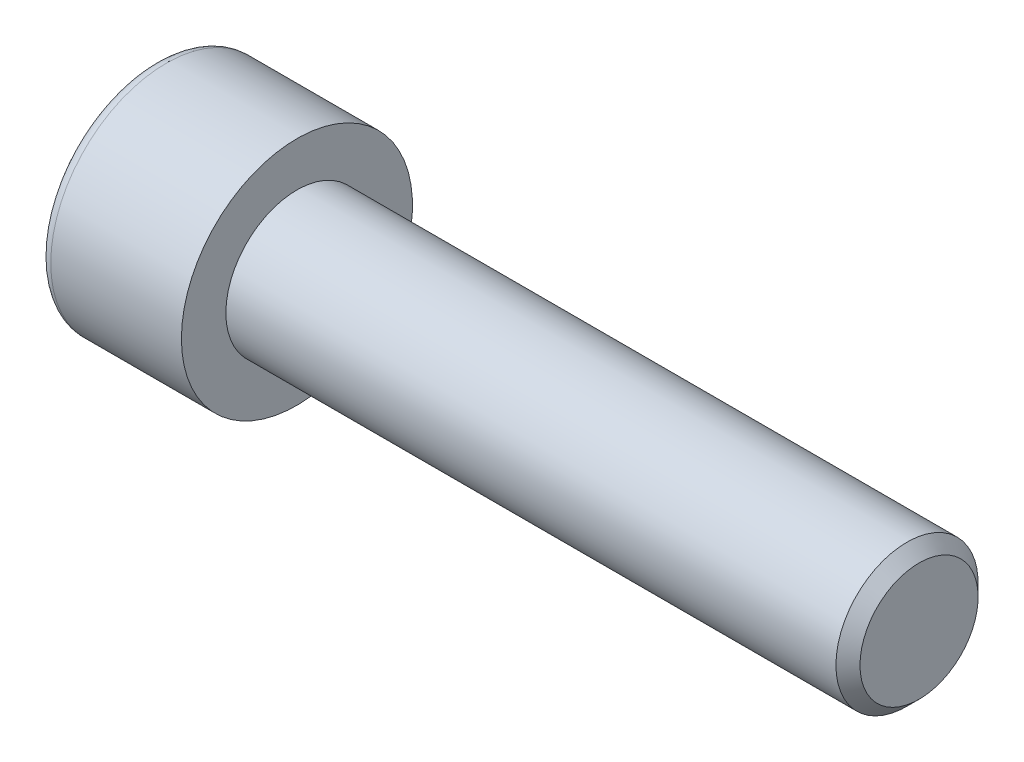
ISO-10303-21;
HEADER;
FILE_DESCRIPTION(('STEP AP214'),'2;1');
FILE_NAME('part.step','',(''),(''),'','','');
FILE_SCHEMA(('AUTOMOTIVE_DESIGN { 1 0 10303 214 1 1 1 1 }'));
ENDSEC;
DATA;
#1=APPLICATION_CONTEXT('core data for automotive mechanical design processes');
#2=APPLICATION_PROTOCOL_DEFINITION('international standard','automotive_design',2000,#1);
#3=PRODUCT_CONTEXT('',#1,'mechanical');
#4=PRODUCT('Part','Part','',(#3));
#5=PRODUCT_RELATED_PRODUCT_CATEGORY('part','',(#4));
#6=PRODUCT_DEFINITION_FORMATION('','',#4);
#7=PRODUCT_DEFINITION_CONTEXT('part definition',#1,'design');
#8=PRODUCT_DEFINITION('design','',#6,#7);
#9=PRODUCT_DEFINITION_SHAPE('','',#8);
#10=(LENGTH_UNIT() NAMED_UNIT(*) SI_UNIT(.MILLI.,.METRE.));
#11=(NAMED_UNIT(*) PLANE_ANGLE_UNIT() SI_UNIT($,.RADIAN.));
#12=(NAMED_UNIT(*) SI_UNIT($,.STERADIAN.) SOLID_ANGLE_UNIT());
#13=UNCERTAINTY_MEASURE_WITH_UNIT(LENGTH_MEASURE(1.E-05),#10,'distance_accuracy_value','');
#14=(GEOMETRIC_REPRESENTATION_CONTEXT(3) GLOBAL_UNCERTAINTY_ASSIGNED_CONTEXT((#13)) GLOBAL_UNIT_ASSIGNED_CONTEXT((#10,
#11,#12)) REPRESENTATION_CONTEXT('',''));
#15=CARTESIAN_POINT('',(0.,0.,0.));
#16=DIRECTION('',(0.,0.,1.));
#17=DIRECTION('',(1.,0.,0.));
#18=AXIS2_PLACEMENT_3D('',#15,#16,#17);
#19=CARTESIAN_POINT('',(0.,0.,0.));
#20=DIRECTION('',(-0.999999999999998,0.,0.));
#21=DIRECTION('',(0.,0.,0.999999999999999));
#22=AXIS2_PLACEMENT_3D('',#19,#20,#21);
#23=PLANE('',#22);
#24=CARTESIAN_POINT('',(0.,0.,0.));
#25=DIRECTION('',(-0.999999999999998,0.,0.));
#26=DIRECTION('',(0.,0.,0.999999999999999));
#27=AXIS2_PLACEMENT_3D('',#24,#25,#26);
#28=CIRCLE('',#27,6.5);
#29=CARTESIAN_POINT('',(0.,0.,6.49999999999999));
#30=VERTEX_POINT('',#29);
#31=EDGE_CURVE('E135',#30,#30,#28,.T.);
#32=ORIENTED_EDGE('',*,*,#31,.F.);
#33=EDGE_LOOP('',(#32));
#34=FACE_BOUND('',#33,.T.);
#35=CARTESIAN_POINT('',(0.,0.,0.));
#36=DIRECTION('',(-0.999999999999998,0.,0.));
#37=DIRECTION('',(0.,0.,0.999999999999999));
#38=AXIS2_PLACEMENT_3D('',#35,#36,#37);
#39=CIRCLE('',#38,4.);
#40=CARTESIAN_POINT('',(0.,0.,4.));
#41=VERTEX_POINT('',#40);
#42=EDGE_CURVE('E11',#41,#41,#39,.F.);
#43=ORIENTED_EDGE('',*,*,#42,.F.);
#44=EDGE_LOOP('',(#43));
#45=FACE_BOUND('',#44,.T.);
#46=ADVANCED_FACE('F43',(#34,#45),#23,.F.);
#47=CARTESIAN_POINT('',(-8.00000000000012,5.8499999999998,0.));
#48=DIRECTION('',(0.999999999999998,0.,0.));
#49=DIRECTION('',(0.,0.,-0.999999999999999));
#50=AXIS2_PLACEMENT_3D('',#47,#48,#49);
#51=PLANE('',#50);
#52=CARTESIAN_POINT('',(-8.00000000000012,0.,0.));
#53=DIRECTION('',(-0.999999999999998,0.,0.));
#54=DIRECTION('',(0.,0.,0.999999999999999));
#55=AXIS2_PLACEMENT_3D('',#52,#53,#54);
#56=CIRCLE('',#55,5.85);
#57=CARTESIAN_POINT('',(-8.00000000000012,0.,5.85));
#58=VERTEX_POINT('',#57);
#59=EDGE_CURVE('E118',#58,#58,#56,.T.);
#60=ORIENTED_EDGE('',*,*,#59,.T.);
#61=EDGE_LOOP('',(#60));
#62=FACE_BOUND('',#61,.T.);
#63=DIRECTION('',(0.,0.500000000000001,0.866025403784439));
#64=VECTOR('',#63,1.);
#65=CARTESIAN_POINT('',(-8.00000000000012,-1.13557621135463,4.03312430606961));
#66=LINE('',#65,#64);
#67=CARTESIAN_POINT('',(-8.00000000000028,-3.4641016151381,-2.22044604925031E-13));
#68=VERTEX_POINT('',#67);
#69=CARTESIAN_POINT('',(-8.00000000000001,-1.73205080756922,2.99999999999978));
#70=VERTEX_POINT('',#69);
#71=EDGE_CURVE('E52',#68,#70,#66,.T.);
#72=ORIENTED_EDGE('',*,*,#71,.F.);
#73=DIRECTION('',(0.,-0.500000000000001,0.866025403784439));
#74=VECTOR('',#73,1.);
#75=CARTESIAN_POINT('',(-7.99999999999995,-1.13557621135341,-4.03312430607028));
#76=LINE('',#75,#74);
#77=CARTESIAN_POINT('',(-7.99999999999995,-1.73205080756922,-3.));
#78=VERTEX_POINT('',#77);
#79=EDGE_CURVE('E67',#78,#68,#76,.T.);
#80=ORIENTED_EDGE('',*,*,#79,.F.);
#81=DIRECTION('',(0.,-1.,0.));
#82=VECTOR('',#81,1.);
#83=CARTESIAN_POINT('',(-7.9999999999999,5.8499999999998,-2.99999999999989));
#84=LINE('',#83,#82);
#85=CARTESIAN_POINT('',(-8.00000000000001,1.73205080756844,-3.000000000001));
#86=VERTEX_POINT('',#85);
#87=EDGE_CURVE('E148',#86,#78,#84,.T.);
#88=ORIENTED_EDGE('',*,*,#87,.F.);
#89=DIRECTION('',(0.,-0.500000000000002,-0.86602540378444));
#90=VECTOR('',#89,1.);
#91=CARTESIAN_POINT('',(-7.99999999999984,4.06057621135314,1.03312430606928));
#92=LINE('',#91,#90);
#93=CARTESIAN_POINT('',(-8.00000000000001,3.46410161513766,-4.44089209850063E-13));
#94=VERTEX_POINT('',#93);
#95=EDGE_CURVE('E145',#94,#86,#92,.T.);
#96=ORIENTED_EDGE('',*,*,#95,.F.);
#97=DIRECTION('',(0.,0.500000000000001,-0.866025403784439));
#98=VECTOR('',#97,1.);
#99=CARTESIAN_POINT('',(-8.00000000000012,4.06057621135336,-1.03312430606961));
#100=LINE('',#99,#98);
#101=CARTESIAN_POINT('',(-8.00000000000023,1.73205080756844,2.99999999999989));
#102=VERTEX_POINT('',#101);
#103=EDGE_CURVE('E142',#102,#94,#100,.T.);
#104=ORIENTED_EDGE('',*,*,#103,.F.);
#105=DIRECTION('',(0.,1.,0.));
#106=VECTOR('',#105,1.);
#107=CARTESIAN_POINT('',(-7.99999999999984,5.8499999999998,2.99999999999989));
#108=LINE('',#107,#106);
#109=EDGE_CURVE('E139',#70,#102,#108,.T.);
#110=ORIENTED_EDGE('',*,*,#109,.F.);
#111=EDGE_LOOP('',(#72,#80,#88,#96,#104,#110));
#112=FACE_BOUND('',#111,.T.);
#113=ADVANCED_FACE('F45',(#62,#112),#51,.F.);
#114=CARTESIAN_POINT('',(-8.00000000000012,0.,0.));
#115=DIRECTION('',(-0.999999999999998,0.,0.));
#116=DIRECTION('',(0.,0.,0.999999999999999));
#117=AXIS2_PLACEMENT_3D('',#114,#115,#116);
#118=CYLINDRICAL_SURFACE('',#117,6.5);
#119=CARTESIAN_POINT('',(-7.35000000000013,-8.88178419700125E-13,-2.22044604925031E-13));
#120=DIRECTION('',(-0.999999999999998,0.,0.));
#121=DIRECTION('',(0.,0.,0.999999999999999));
#122=AXIS2_PLACEMENT_3D('',#119,#120,#121);
#123=CIRCLE('',#122,6.5);
#124=CARTESIAN_POINT('',(-7.35000000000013,0.,6.49999999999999));
#125=VERTEX_POINT('',#124);
#126=EDGE_CURVE('E125',#125,#125,#123,.T.);
#127=CARTESIAN_POINT('',(-7.35000000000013,0.,6.49999999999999));
#128=CARTESIAN_POINT('',(-7.27343750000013,0.,6.49999999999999));
#129=CARTESIAN_POINT('',(-7.19687500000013,0.,6.49999999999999));
#130=CARTESIAN_POINT('',(-7.04375000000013,0.,6.49999999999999));
#131=CARTESIAN_POINT('',(-6.96718750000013,0.,6.49999999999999));
#132=CARTESIAN_POINT('',(-6.81406250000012,0.,6.49999999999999));
#133=CARTESIAN_POINT('',(-6.73750000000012,0.,6.49999999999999));
#134=CARTESIAN_POINT('',(-6.58437500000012,0.,6.49999999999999));
#135=CARTESIAN_POINT('',(-6.50781250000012,0.,6.49999999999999));
#136=CARTESIAN_POINT('',(-6.35468750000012,0.,6.49999999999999));
#137=CARTESIAN_POINT('',(-6.27812500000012,0.,6.49999999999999));
#138=CARTESIAN_POINT('',(-6.12500000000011,0.,6.49999999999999));
#139=CARTESIAN_POINT('',(-6.04843750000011,0.,6.49999999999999));
#140=CARTESIAN_POINT('',(-5.89531250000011,0.,6.49999999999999));
#141=CARTESIAN_POINT('',(-5.81875000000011,0.,6.49999999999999));
#142=CARTESIAN_POINT('',(-5.6656250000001,0.,6.49999999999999));
#143=CARTESIAN_POINT('',(-5.5890625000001,0.,6.49999999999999));
#144=CARTESIAN_POINT('',(-5.4359375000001,0.,6.49999999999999));
#145=CARTESIAN_POINT('',(-5.3593750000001,0.,6.49999999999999));
#146=CARTESIAN_POINT('',(-5.2062500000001,0.,6.49999999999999));
#147=CARTESIAN_POINT('',(-5.1296875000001,0.,6.49999999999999));
#148=CARTESIAN_POINT('',(-4.97656250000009,0.,6.49999999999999));
#149=CARTESIAN_POINT('',(-4.90000000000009,0.,6.49999999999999));
#150=CARTESIAN_POINT('',(-4.74687500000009,0.,6.49999999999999));
#151=CARTESIAN_POINT('',(-4.67031250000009,0.,6.49999999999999));
#152=CARTESIAN_POINT('',(-4.51718750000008,0.,6.49999999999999));
#153=CARTESIAN_POINT('',(-4.44062500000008,0.,6.49999999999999));
#154=CARTESIAN_POINT('',(-4.28750000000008,0.,6.49999999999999));
#155=CARTESIAN_POINT('',(-4.21093750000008,0.,6.49999999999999));
#156=CARTESIAN_POINT('',(-4.05781250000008,0.,6.49999999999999));
#157=CARTESIAN_POINT('',(-3.98125000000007,0.,6.49999999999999));
#158=CARTESIAN_POINT('',(-3.82812500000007,0.,6.49999999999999));
#159=CARTESIAN_POINT('',(-3.75156250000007,0.,6.49999999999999));
#160=CARTESIAN_POINT('',(-3.59843750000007,0.,6.49999999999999));
#161=CARTESIAN_POINT('',(-3.52187500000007,0.,6.49999999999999));
#162=CARTESIAN_POINT('',(-3.36875000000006,0.,6.49999999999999));
#163=CARTESIAN_POINT('',(-3.29218750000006,0.,6.49999999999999));
#164=CARTESIAN_POINT('',(-3.13906250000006,0.,6.49999999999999));
#165=CARTESIAN_POINT('',(-3.06250000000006,0.,6.49999999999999));
#166=CARTESIAN_POINT('',(-2.90937500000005,0.,6.49999999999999));
#167=CARTESIAN_POINT('',(-2.83281250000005,0.,6.49999999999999));
#168=CARTESIAN_POINT('',(-2.67968750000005,0.,6.49999999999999));
#169=CARTESIAN_POINT('',(-2.60312500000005,0.,6.49999999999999));
#170=CARTESIAN_POINT('',(-2.45000000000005,0.,6.49999999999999));
#171=CARTESIAN_POINT('',(-2.37343750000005,0.,6.49999999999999));
#172=CARTESIAN_POINT('',(-2.22031250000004,0.,6.49999999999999));
#173=CARTESIAN_POINT('',(-2.14375000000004,0.,6.49999999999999));
#174=CARTESIAN_POINT('',(-1.99062500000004,0.,6.49999999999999));
#175=CARTESIAN_POINT('',(-1.91406250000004,0.,6.49999999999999));
#176=CARTESIAN_POINT('',(-1.76093750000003,0.,6.49999999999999));
#177=CARTESIAN_POINT('',(-1.68437500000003,0.,6.49999999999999));
#178=CARTESIAN_POINT('',(-1.53125000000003,0.,6.49999999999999));
#179=CARTESIAN_POINT('',(-1.45468750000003,0.,6.49999999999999));
#180=CARTESIAN_POINT('',(-1.30156250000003,0.,6.49999999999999));
#181=CARTESIAN_POINT('',(-1.22500000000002,0.,6.49999999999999));
#182=CARTESIAN_POINT('',(-1.07187500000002,0.,6.49999999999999));
#183=CARTESIAN_POINT('',(-0.99531250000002,0.,6.49999999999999));
#184=CARTESIAN_POINT('',(-0.842187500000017,0.,6.49999999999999));
#185=CARTESIAN_POINT('',(-0.765625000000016,0.,6.49999999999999));
#186=CARTESIAN_POINT('',(-0.612500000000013,0.,6.49999999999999));
#187=CARTESIAN_POINT('',(-0.535937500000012,0.,6.49999999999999));
#188=CARTESIAN_POINT('',(-0.382812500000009,0.,6.49999999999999));
#189=CARTESIAN_POINT('',(-0.306250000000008,0.,6.49999999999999));
#190=CARTESIAN_POINT('',(-0.153125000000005,0.,6.49999999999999));
#191=CARTESIAN_POINT('',(-0.0765625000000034,0.,6.49999999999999));
#192=CARTESIAN_POINT('',(0.,0.,6.49999999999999));
#193=B_SPLINE_CURVE_WITH_KNOTS('',3,(#127,#128,#129,#130,#131,#132,#133,#134,#135,#136,#137,
#138,#139,#140,#141,#142,#143,#144,#145,#146,#147,#148,#149,#150,#151,#152,#153,#154,#155,#156,
#157,#158,#159,#160,#161,#162,#163,#164,#165,#166,#167,#168,#169,#170,#171,#172,#173,#174,#175,
#176,#177,#178,#179,#180,#181,#182,#183,#184,#185,#186,#187,#188,#189,#190,#191,#192),
.UNSPECIFIED.,.F.,.F.,(4,2,2,2,2,2,2,2,2,2,2,2,2,2,2,2,2,2,2,2,2,2,2,2,2,2,2,2,2,2,2,2,4),(0.,
0.229687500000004,0.459375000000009,0.689062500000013,0.918750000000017,1.14843750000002,
1.37812500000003,1.60781250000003,1.83750000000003,2.06718750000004,2.29687500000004,
2.52656250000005,2.75625000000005,2.98593750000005,3.21562500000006,3.44531250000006,
3.67500000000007,3.90468750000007,4.13437500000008,4.36406250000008,4.59375000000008,
4.82343750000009,5.05312500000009,5.2828125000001,5.5125000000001,5.7421875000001,
5.97187500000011,6.20156250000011,6.43125000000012,6.66093750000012,6.89062500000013,
7.12031250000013,7.35000000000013),.UNSPECIFIED.);
#194=EDGE_CURVE('BSEAM232',#125,#30,#193,.T.);
#195=ORIENTED_EDGE('',*,*,#126,.F.);
#196=ORIENTED_EDGE('',*,*,#31,.T.);
#197=ORIENTED_EDGE('',*,*,#194,.T.);
#198=ORIENTED_EDGE('',*,*,#194,.F.);
#199=EDGE_LOOP('',(#195,#197,#196,#198));
#200=FACE_BOUND('',#199,.T.);
#201=ADVANCED_FACE('F232',(#200),#118,.T.);
#202=CARTESIAN_POINT('',(-7.35000000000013,-8.88178419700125E-13,-2.22044604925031E-13));
#203=DIRECTION('',(-0.999999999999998,0.,0.));
#204=DIRECTION('',(0.,0.,0.999999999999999));
#205=AXIS2_PLACEMENT_3D('',#202,#203,#204);
#206=TOROIDAL_SURFACE('',#205,5.85,0.65);
#207=ORIENTED_EDGE('',*,*,#59,.F.);
#208=EDGE_LOOP('',(#207));
#209=FACE_BOUND('',#208,.T.);
#210=ORIENTED_EDGE('',*,*,#126,.T.);
#211=EDGE_LOOP('',(#210));
#212=FACE_BOUND('',#211,.T.);
#213=ADVANCED_FACE('F239',(#209,#212),#206,.T.);
#214=CARTESIAN_POINT('',(-4.00000000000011,-1.73205080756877,2.99999999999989));
#215=DIRECTION('',(0.,0.866025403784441,-0.499999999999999));
#216=DIRECTION('',(0.,0.500000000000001,0.866025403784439));
#217=AXIS2_PLACEMENT_3D('',#214,#215,#216);
#218=PLANE('',#217);
#219=ORIENTED_EDGE('',*,*,#71,.T.);
#220=DIRECTION('',(-0.999999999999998,0.,0.));
#221=VECTOR('',#220,1.);
#222=CARTESIAN_POINT('',(-4.00000000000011,-1.73205080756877,2.99999999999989));
#223=LINE('',#222,#221);
#224=CARTESIAN_POINT('',(-4.00000000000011,-1.73205080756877,2.99999999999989));
#225=VERTEX_POINT('',#224);
#226=EDGE_CURVE('E59',#225,#70,#223,.T.);
#227=ORIENTED_EDGE('',*,*,#226,.F.);
#228=DIRECTION('',(0.,-0.500000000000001,-0.866025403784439));
#229=VECTOR('',#228,1.);
#230=CARTESIAN_POINT('',(-4.00000000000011,-1.73205080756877,2.99999999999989));
#231=LINE('',#230,#229);
#232=CARTESIAN_POINT('',(-4.00000000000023,-3.4641016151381,-3.33066907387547E-13));
#233=VERTEX_POINT('',#232);
#234=EDGE_CURVE('E103',#225,#233,#231,.T.);
#235=ORIENTED_EDGE('',*,*,#234,.T.);
#236=DIRECTION('',(-0.999999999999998,0.,0.));
#237=VECTOR('',#236,1.);
#238=CARTESIAN_POINT('',(-4.00000000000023,-3.4641016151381,-3.33066907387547E-13));
#239=LINE('',#238,#237);
#240=EDGE_CURVE('E111',#233,#68,#239,.T.);
#241=ORIENTED_EDGE('',*,*,#240,.T.);
#242=EDGE_LOOP('',(#219,#227,#235,#241));
#243=FACE_BOUND('',#242,.T.);
#244=ADVANCED_FACE('F110',(#243),#218,.T.);
#245=CARTESIAN_POINT('',(-4.00000000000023,-3.4641016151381,-3.33066907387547E-13));
#246=DIRECTION('',(0.,0.866025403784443,0.499999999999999));
#247=DIRECTION('',(0.,-0.500000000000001,0.866025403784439));
#248=AXIS2_PLACEMENT_3D('',#245,#246,#247);
#249=PLANE('',#248);
#250=ORIENTED_EDGE('',*,*,#79,.T.);
#251=ORIENTED_EDGE('',*,*,#240,.F.);
#252=DIRECTION('',(0.,0.500000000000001,-0.866025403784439));
#253=VECTOR('',#252,1.);
#254=CARTESIAN_POINT('',(-4.00000000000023,-3.4641016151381,-3.33066907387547E-13));
#255=LINE('',#254,#253);
#256=CARTESIAN_POINT('',(-4.,-1.73205080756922,-3.00000000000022));
#257=VERTEX_POINT('',#256);
#258=EDGE_CURVE('E99',#233,#257,#255,.T.);
#259=ORIENTED_EDGE('',*,*,#258,.T.);
#260=DIRECTION('',(-0.999999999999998,0.,0.));
#261=VECTOR('',#260,1.);
#262=CARTESIAN_POINT('',(-4.,-1.73205080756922,-3.00000000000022));
#263=LINE('',#262,#261);
#264=EDGE_CURVE('E119',#257,#78,#263,.T.);
#265=ORIENTED_EDGE('',*,*,#264,.T.);
#266=EDGE_LOOP('',(#250,#251,#259,#265));
#267=FACE_BOUND('',#266,.T.);
#268=ADVANCED_FACE('F116',(#267),#249,.T.);
#269=CARTESIAN_POINT('',(-4.,-1.73205080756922,-3.00000000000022));
#270=DIRECTION('',(0.,0.,1.));
#271=DIRECTION('',(0.,-1.,0.));
#272=AXIS2_PLACEMENT_3D('',#269,#270,#271);
#273=PLANE('',#272);
#274=ORIENTED_EDGE('',*,*,#87,.T.);
#275=ORIENTED_EDGE('',*,*,#264,.F.);
#276=DIRECTION('',(0.,1.,0.));
#277=VECTOR('',#276,1.);
#278=CARTESIAN_POINT('',(-4.,-1.73205080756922,-3.00000000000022));
#279=LINE('',#278,#277);
#280=CARTESIAN_POINT('',(-4.00000000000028,1.73205080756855,-3.00000000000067));
#281=VERTEX_POINT('',#280);
#282=EDGE_CURVE('E105',#257,#281,#279,.T.);
#283=ORIENTED_EDGE('',*,*,#282,.T.);
#284=DIRECTION('',(-0.999999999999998,0.,0.));
#285=VECTOR('',#284,1.);
#286=CARTESIAN_POINT('',(-4.00000000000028,1.73205080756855,-3.00000000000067));
#287=LINE('',#286,#285);
#288=EDGE_CURVE('E128',#281,#86,#287,.T.);
#289=ORIENTED_EDGE('',*,*,#288,.T.);
#290=EDGE_LOOP('',(#274,#275,#283,#289));
#291=FACE_BOUND('',#290,.T.);
#292=ADVANCED_FACE('F187',(#291),#273,.T.);
#293=CARTESIAN_POINT('',(-4.00000000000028,1.73205080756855,-3.00000000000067));
#294=DIRECTION('',(0.,-0.866025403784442,0.499999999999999));
#295=DIRECTION('',(0.,-0.500000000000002,-0.86602540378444));
#296=AXIS2_PLACEMENT_3D('',#293,#294,#295);
#297=PLANE('',#296);
#298=ORIENTED_EDGE('',*,*,#95,.T.);
#299=ORIENTED_EDGE('',*,*,#288,.F.);
#300=DIRECTION('',(0.,0.500000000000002,0.86602540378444));
#301=VECTOR('',#300,1.);
#302=CARTESIAN_POINT('',(-4.00000000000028,1.73205080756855,-3.00000000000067));
#303=LINE('',#302,#301);
#304=CARTESIAN_POINT('',(-4.,3.46410161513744,-2.22044604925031E-13));
#305=VERTEX_POINT('',#304);
#306=EDGE_CURVE('E190',#281,#305,#303,.T.);
#307=ORIENTED_EDGE('',*,*,#306,.T.);
#308=DIRECTION('',(-0.999999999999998,0.,0.));
#309=VECTOR('',#308,1.);
#310=CARTESIAN_POINT('',(-4.,3.46410161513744,-2.22044604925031E-13));
#311=LINE('',#310,#309);
#312=EDGE_CURVE('E169',#305,#94,#311,.T.);
#313=ORIENTED_EDGE('',*,*,#312,.T.);
#314=EDGE_LOOP('',(#298,#299,#307,#313));
#315=FACE_BOUND('',#314,.T.);
#316=ADVANCED_FACE('F189',(#315),#297,.T.);
#317=CARTESIAN_POINT('',(-4.,3.46410161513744,-2.22044604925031E-13));
#318=DIRECTION('',(0.,-0.866025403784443,-0.499999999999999));
#319=DIRECTION('',(0.,0.500000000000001,-0.866025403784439));
#320=AXIS2_PLACEMENT_3D('',#317,#318,#319);
#321=PLANE('',#320);
#322=ORIENTED_EDGE('',*,*,#103,.T.);
#323=ORIENTED_EDGE('',*,*,#312,.F.);
#324=DIRECTION('',(0.,-0.500000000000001,0.866025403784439));
#325=VECTOR('',#324,1.);
#326=CARTESIAN_POINT('',(-4.,3.46410161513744,-2.22044604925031E-13));
#327=LINE('',#326,#325);
#328=CARTESIAN_POINT('',(-3.99999999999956,1.73205080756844,2.99999999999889));
#329=VERTEX_POINT('',#328);
#330=EDGE_CURVE('E167',#305,#329,#327,.T.);
#331=ORIENTED_EDGE('',*,*,#330,.T.);
#332=DIRECTION('',(-0.999999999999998,0.,0.));
#333=VECTOR('',#332,1.);
#334=CARTESIAN_POINT('',(-3.99999999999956,1.73205080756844,2.99999999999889));
#335=LINE('',#334,#333);
#336=EDGE_CURVE('E161',#329,#102,#335,.T.);
#337=ORIENTED_EDGE('',*,*,#336,.T.);
#338=EDGE_LOOP('',(#322,#323,#331,#337));
#339=FACE_BOUND('',#338,.T.);
#340=ADVANCED_FACE('F163',(#339),#321,.T.);
#341=CARTESIAN_POINT('',(-3.99999999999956,1.73205080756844,2.99999999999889));
#342=DIRECTION('',(0.,0.,-0.999999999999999));
#343=DIRECTION('',(0.,1.,0.));
#344=AXIS2_PLACEMENT_3D('',#341,#342,#343);
#345=PLANE('',#344);
#346=ORIENTED_EDGE('',*,*,#109,.T.);
#347=ORIENTED_EDGE('',*,*,#336,.F.);
#348=DIRECTION('',(0.,-1.,0.));
#349=VECTOR('',#348,1.);
#350=CARTESIAN_POINT('',(-3.99999999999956,1.73205080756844,2.99999999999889));
#351=LINE('',#350,#349);
#352=EDGE_CURVE('E177',#329,#225,#351,.T.);
#353=ORIENTED_EDGE('',*,*,#352,.T.);
#354=ORIENTED_EDGE('',*,*,#226,.T.);
#355=EDGE_LOOP('',(#346,#347,#353,#354));
#356=FACE_BOUND('',#355,.T.);
#357=ADVANCED_FACE('F160',(#356),#345,.T.);
#358=CARTESIAN_POINT('',(-4.00000000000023,-3.4641016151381,-3.33066907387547E-13));
#359=DIRECTION('',(0.999999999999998,0.,0.));
#360=DIRECTION('',(0.,0.,0.999999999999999));
#361=AXIS2_PLACEMENT_3D('',#358,#359,#360);
#362=PLANE('',#361);
#363=ORIENTED_EDGE('',*,*,#234,.F.);
#364=ORIENTED_EDGE('',*,*,#352,.F.);
#365=ORIENTED_EDGE('',*,*,#330,.F.);
#366=ORIENTED_EDGE('',*,*,#306,.F.);
#367=ORIENTED_EDGE('',*,*,#282,.F.);
#368=ORIENTED_EDGE('',*,*,#258,.F.);
#369=EDGE_LOOP('',(#363,#364,#365,#366,#367,#368));
#370=FACE_BOUND('',#369,.T.);
#371=ADVANCED_FACE('F101',(#370),#362,.F.);
#372=CARTESIAN_POINT('',(34.9999999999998,-1.11022302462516E-13,0.));
#373=DIRECTION('',(-0.999999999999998,0.,0.));
#374=DIRECTION('',(0.,0.,0.999999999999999));
#375=AXIS2_PLACEMENT_3D('',#372,#373,#374);
#376=PLANE('',#375);
#377=CARTESIAN_POINT('',(34.9999999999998,-1.11022302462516E-13,0.));
#378=DIRECTION('',(-0.999999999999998,0.,0.));
#379=DIRECTION('',(0.,0.,0.999999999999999));
#380=AXIS2_PLACEMENT_3D('',#377,#378,#379);
#381=CIRCLE('',#380,3.3234375);
#382=CARTESIAN_POINT('',(34.9999999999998,-1.11022302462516E-13,3.32343749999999));
#383=VERTEX_POINT('',#382);
#384=EDGE_CURVE('E114',#383,#383,#381,.T.);
#385=ORIENTED_EDGE('',*,*,#384,.F.);
#386=EDGE_LOOP('',(#385));
#387=FACE_BOUND('',#386,.T.);
#388=ADVANCED_FACE('F217',(#387),#376,.F.);
#389=CARTESIAN_POINT('',(34.9999999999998,-1.11022302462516E-13,0.));
#390=DIRECTION('',(-0.999999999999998,0.,0.));
#391=DIRECTION('',(0.,0.,0.999999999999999));
#392=AXIS2_PLACEMENT_3D('',#389,#390,#391);
#393=CONICAL_SURFACE('',#392,3.3234375,0.785398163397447);
#394=CARTESIAN_POINT('',(34.3234374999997,-2.22044604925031E-13,-2.22044604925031E-13));
#395=DIRECTION('',(-0.999999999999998,0.,0.));
#396=DIRECTION('',(0.,0.,0.999999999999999));
#397=AXIS2_PLACEMENT_3D('',#394,#395,#396);
#398=CIRCLE('',#397,4.);
#399=CARTESIAN_POINT('',(34.3234374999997,-1.12449459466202E-13,4.00000000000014));
#400=VERTEX_POINT('',#399);
#401=EDGE_CURVE('E203',#400,#400,#398,.T.);
#402=CARTESIAN_POINT('',(34.3234374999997,-1.12449459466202E-13,4.00000000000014));
#403=CARTESIAN_POINT('',(34.3304850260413,-1.12434593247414E-13,3.99295247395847));
#404=CARTESIAN_POINT('',(34.337532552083,-1.12419727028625E-13,3.98590494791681));
#405=CARTESIAN_POINT('',(34.3516276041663,-1.12389994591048E-13,3.97180989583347));
#406=CARTESIAN_POINT('',(34.358675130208,-1.1237512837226E-13,3.9647623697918));
#407=CARTESIAN_POINT('',(34.3727701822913,-1.12345395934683E-13,3.95066731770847));
#408=CARTESIAN_POINT('',(34.379817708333,-1.12330529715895E-13,3.9436197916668));
#409=CARTESIAN_POINT('',(34.3939127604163,-1.12300797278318E-13,3.92952473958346));
#410=CARTESIAN_POINT('',(34.400960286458,-1.1228593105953E-13,3.92247721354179));
#411=CARTESIAN_POINT('',(34.4150553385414,-1.12256198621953E-13,3.90838216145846));
#412=CARTESIAN_POINT('',(34.422102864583,-1.12241332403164E-13,3.90133463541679));
#413=CARTESIAN_POINT('',(34.4361979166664,-1.12211599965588E-13,3.88723958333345));
#414=CARTESIAN_POINT('',(34.443245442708,-1.12196733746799E-13,3.88019205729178));
#415=CARTESIAN_POINT('',(34.4573404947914,-1.12167001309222E-13,3.86609700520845));
#416=CARTESIAN_POINT('',(34.464388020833,-1.12152135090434E-13,3.85904947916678));
#417=CARTESIAN_POINT('',(34.4784830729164,-1.12122402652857E-13,3.84495442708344));
#418=CARTESIAN_POINT('',(34.485530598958,-1.12107536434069E-13,3.83790690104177));
#419=CARTESIAN_POINT('',(34.4996256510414,-1.12077803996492E-13,3.82381184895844));
#420=CARTESIAN_POINT('',(34.506673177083,-1.12062937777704E-13,3.81676432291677));
#421=CARTESIAN_POINT('',(34.5207682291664,-1.12033205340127E-13,3.80266927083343));
#422=CARTESIAN_POINT('',(34.527815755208,-1.12018339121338E-13,3.79562174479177));
#423=CARTESIAN_POINT('',(34.5419108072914,-1.11988606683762E-13,3.78152669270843));
#424=CARTESIAN_POINT('',(34.548958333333,-1.11973740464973E-13,3.77447916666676));
#425=CARTESIAN_POINT('',(34.5630533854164,-1.11944008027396E-13,3.76038411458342));
#426=CARTESIAN_POINT('',(34.570100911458,-1.11929141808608E-13,3.75333658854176));
#427=CARTESIAN_POINT('',(34.5841959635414,-1.11899409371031E-13,3.73924153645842));
#428=CARTESIAN_POINT('',(34.5912434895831,-1.11884543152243E-13,3.73219401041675));
#429=CARTESIAN_POINT('',(34.6053385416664,-1.11854810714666E-13,3.71809895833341));
#430=CARTESIAN_POINT('',(34.6123860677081,-1.11839944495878E-13,3.71105143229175));
#431=CARTESIAN_POINT('',(34.6264811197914,-1.11810212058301E-13,3.69695638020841));
#432=CARTESIAN_POINT('',(34.6335286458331,-1.11795345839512E-13,3.68990885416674));
#433=CARTESIAN_POINT('',(34.6476236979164,-1.11765613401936E-13,3.6758138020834));
#434=CARTESIAN_POINT('',(34.6546712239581,-1.11750747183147E-13,3.66876627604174));
#435=CARTESIAN_POINT('',(34.6687662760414,-1.1172101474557E-13,3.6546712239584));
#436=CARTESIAN_POINT('',(34.6758138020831,-1.11706148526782E-13,3.64762369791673));
#437=CARTESIAN_POINT('',(34.6899088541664,-1.11676416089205E-13,3.6335286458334));
#438=CARTESIAN_POINT('',(34.6969563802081,-1.11661549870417E-13,3.62648111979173));
#439=CARTESIAN_POINT('',(34.7110514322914,-1.1163181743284E-13,3.61238606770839));
#440=CARTESIAN_POINT('',(34.7180989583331,-1.11616951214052E-13,3.60533854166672));
#441=CARTESIAN_POINT('',(34.7321940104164,-1.11587218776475E-13,3.59124348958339));
#442=CARTESIAN_POINT('',(34.7392415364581,-1.11572352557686E-13,3.58419596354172));
#443=CARTESIAN_POINT('',(34.7533365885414,-1.1154262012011E-13,3.57010091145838));
#444=CARTESIAN_POINT('',(34.7603841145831,-1.11527753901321E-13,3.56305338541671));
#445=CARTESIAN_POINT('',(34.7744791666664,-1.11498021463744E-13,3.54895833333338));
#446=CARTESIAN_POINT('',(34.7815266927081,-1.11483155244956E-13,3.54191080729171));
#447=CARTESIAN_POINT('',(34.7956217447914,-1.11453422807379E-13,3.52781575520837));
#448=CARTESIAN_POINT('',(34.8026692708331,-1.11438556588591E-13,3.52076822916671));
#449=CARTESIAN_POINT('',(34.8167643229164,-1.11408824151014E-13,3.50667317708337));
#450=CARTESIAN_POINT('',(34.8238118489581,-1.11393957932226E-13,3.4996256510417));
#451=CARTESIAN_POINT('',(34.8379069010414,-1.11364225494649E-13,3.48553059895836));
#452=CARTESIAN_POINT('',(34.8449544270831,-1.1134935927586E-13,3.4784830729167));
#453=CARTESIAN_POINT('',(34.8590494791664,-1.11319626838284E-13,3.46438802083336));
#454=CARTESIAN_POINT('',(34.8660970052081,-1.11304760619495E-13,3.45734049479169));
#455=CARTESIAN_POINT('',(34.8801920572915,-1.11275028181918E-13,3.44324544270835));
#456=CARTESIAN_POINT('',(34.8872395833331,-1.1126016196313E-13,3.43619791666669));
#457=CARTESIAN_POINT('',(34.9013346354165,-1.11230429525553E-13,3.42210286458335));
#458=CARTESIAN_POINT('',(34.9083821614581,-1.11215563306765E-13,3.41505533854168));
#459=CARTESIAN_POINT('',(34.9224772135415,-1.11185830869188E-13,3.40096028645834));
#460=CARTESIAN_POINT('',(34.9295247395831,-1.111709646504E-13,3.39391276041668));
#461=CARTESIAN_POINT('',(34.9436197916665,-1.11141232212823E-13,3.37981770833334));
#462=CARTESIAN_POINT('',(34.9506673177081,-1.11126365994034E-13,3.37277018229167));
#463=CARTESIAN_POINT('',(34.9647623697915,-1.11096633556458E-13,3.35867513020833));
#464=CARTESIAN_POINT('',(34.9718098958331,-1.11081767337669E-13,3.35162760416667));
#465=CARTESIAN_POINT('',(34.9859049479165,-1.11052034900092E-13,3.33753255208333));
#466=CARTESIAN_POINT('',(34.9929524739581,-1.11037168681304E-13,3.33048502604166));
#467=CARTESIAN_POINT('',(34.9999999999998,-1.11022302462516E-13,3.32343749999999));
#468=B_SPLINE_CURVE_WITH_KNOTS('',3,(#402,#403,#404,#405,#406,#407,#408,#409,#410,#411,#412,
#413,#414,#415,#416,#417,#418,#419,#420,#421,#422,#423,#424,#425,#426,#427,#428,#429,#430,#431,
#432,#433,#434,#435,#436,#437,#438,#439,#440,#441,#442,#443,#444,#445,#446,#447,#448,#449,#450,
#451,#452,#453,#454,#455,#456,#457,#458,#459,#460,#461,#462,#463,#464,#465,#466,#467),
.UNSPECIFIED.,.F.,.F.,(4,2,2,2,2,2,2,2,2,2,2,2,2,2,2,2,2,2,2,2,2,2,2,2,2,2,2,2,2,2,2,2,4),(0.,
0.0299001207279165,0.0598002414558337,0.0897003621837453,0.119600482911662,0.149500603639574,
0.17940072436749,0.209300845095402,0.239200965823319,0.26910108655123,0.299001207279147,
0.328901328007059,0.358801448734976,0.388701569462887,0.418601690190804,0.448501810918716,
0.478401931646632,0.508302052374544,0.538202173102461,0.568102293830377,0.598002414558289,
0.627902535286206,0.657802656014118,0.687702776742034,0.717602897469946,0.747503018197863,
0.777403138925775,0.807303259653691,0.837203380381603,0.86710350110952,0.897003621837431,
0.926903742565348,0.95680386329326),.UNSPECIFIED.);
#469=EDGE_CURVE('BSEAM214',#400,#383,#468,.T.);
#470=ORIENTED_EDGE('',*,*,#401,.F.);
#471=ORIENTED_EDGE('',*,*,#384,.T.);
#472=ORIENTED_EDGE('',*,*,#469,.T.);
#473=ORIENTED_EDGE('',*,*,#469,.F.);
#474=EDGE_LOOP('',(#470,#472,#471,#473));
#475=FACE_BOUND('',#474,.T.);
#476=ADVANCED_FACE('F214',(#475),#393,.T.);
#477=CARTESIAN_POINT('',(0.,0.,0.));
#478=DIRECTION('',(-0.999999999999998,0.,0.));
#479=DIRECTION('',(0.,0.,0.999999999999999));
#480=AXIS2_PLACEMENT_3D('',#477,#478,#479);
#481=CYLINDRICAL_SURFACE('',#480,4.);
#482=CARTESIAN_POINT('',(34.3234374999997,0.,4.));
#483=CARTESIAN_POINT('',(33.965901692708,0.,4.));
#484=CARTESIAN_POINT('',(33.6083658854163,0.,4.));
#485=CARTESIAN_POINT('',(32.893294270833,0.,4.));
#486=CARTESIAN_POINT('',(32.5357584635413,0.,4.));
#487=CARTESIAN_POINT('',(31.820686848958,0.,4.));
#488=CARTESIAN_POINT('',(31.4631510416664,0.,4.));
#489=CARTESIAN_POINT('',(30.748079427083,0.,4.));
#490=CARTESIAN_POINT('',(30.3905436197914,0.,4.));
#491=CARTESIAN_POINT('',(29.675472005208,0.,4.));
#492=CARTESIAN_POINT('',(29.3179361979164,0.,4.));
#493=CARTESIAN_POINT('',(28.6028645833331,0.,4.));
#494=CARTESIAN_POINT('',(28.2453287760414,0.,4.));
#495=CARTESIAN_POINT('',(27.5302571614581,0.,4.));
#496=CARTESIAN_POINT('',(27.1727213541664,0.,4.));
#497=CARTESIAN_POINT('',(26.4576497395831,0.,4.));
#498=CARTESIAN_POINT('',(26.1001139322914,0.,4.));
#499=CARTESIAN_POINT('',(25.3850423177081,0.,4.));
#500=CARTESIAN_POINT('',(25.0275065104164,0.,4.));
#501=CARTESIAN_POINT('',(24.3124348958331,0.,4.));
#502=CARTESIAN_POINT('',(23.9548990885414,0.,4.));
#503=CARTESIAN_POINT('',(23.2398274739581,0.,4.));
#504=CARTESIAN_POINT('',(22.8822916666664,0.,4.));
#505=CARTESIAN_POINT('',(22.1672200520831,0.,4.));
#506=CARTESIAN_POINT('',(21.8096842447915,0.,4.));
#507=CARTESIAN_POINT('',(21.0946126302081,0.,4.));
#508=CARTESIAN_POINT('',(20.7370768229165,0.,4.));
#509=CARTESIAN_POINT('',(20.0220052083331,0.,4.));
#510=CARTESIAN_POINT('',(19.6644694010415,0.,4.));
#511=CARTESIAN_POINT('',(18.9493977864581,0.,4.));
#512=CARTESIAN_POINT('',(18.5918619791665,0.,4.));
#513=CARTESIAN_POINT('',(17.8767903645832,0.,4.));
#514=CARTESIAN_POINT('',(17.5192545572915,0.,4.));
#515=CARTESIAN_POINT('',(16.8041829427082,0.,4.));
#516=CARTESIAN_POINT('',(16.4466471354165,0.,4.));
#517=CARTESIAN_POINT('',(15.7315755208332,0.,4.));
#518=CARTESIAN_POINT('',(15.3740397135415,0.,4.));
#519=CARTESIAN_POINT('',(14.6589680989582,0.,4.));
#520=CARTESIAN_POINT('',(14.3014322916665,0.,4.));
#521=CARTESIAN_POINT('',(13.5863606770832,0.,4.));
#522=CARTESIAN_POINT('',(13.2288248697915,0.,4.));
#523=CARTESIAN_POINT('',(12.5137532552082,0.,4.));
#524=CARTESIAN_POINT('',(12.1562174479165,0.,4.));
#525=CARTESIAN_POINT('',(11.4411458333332,0.,4.));
#526=CARTESIAN_POINT('',(11.0836100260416,0.,4.));
#527=CARTESIAN_POINT('',(10.3685384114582,0.,4.));
#528=CARTESIAN_POINT('',(10.0110026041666,0.,4.));
#529=CARTESIAN_POINT('',(9.29593098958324,0.,4.));
#530=CARTESIAN_POINT('',(8.93839518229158,0.,4.));
#531=CARTESIAN_POINT('',(8.22332356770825,0.,4.));
#532=CARTESIAN_POINT('',(7.86578776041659,0.,4.));
#533=CARTESIAN_POINT('',(7.15071614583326,0.,4.));
#534=CARTESIAN_POINT('',(6.7931803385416,0.,4.));
#535=CARTESIAN_POINT('',(6.07810872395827,0.,4.));
#536=CARTESIAN_POINT('',(5.72057291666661,0.,4.));
#537=CARTESIAN_POINT('',(5.00550130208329,0.,4.));
#538=CARTESIAN_POINT('',(4.64796549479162,0.,4.));
#539=CARTESIAN_POINT('',(3.9328938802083,0.,4.));
#540=CARTESIAN_POINT('',(3.57535807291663,0.,4.));
#541=CARTESIAN_POINT('',(2.86028645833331,0.,4.));
#542=CARTESIAN_POINT('',(2.50275065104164,0.,4.));
#543=CARTESIAN_POINT('',(1.78767903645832,0.,4.));
#544=CARTESIAN_POINT('',(1.43014322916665,0.,4.));
#545=CARTESIAN_POINT('',(0.715071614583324,0.,4.));
#546=CARTESIAN_POINT('',(0.357535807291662,0.,4.));
#547=CARTESIAN_POINT('',(0.,0.,4.));
#548=B_SPLINE_CURVE_WITH_KNOTS('',3,(#482,#483,#484,#485,#486,#487,#488,#489,#490,#491,#492,
#493,#494,#495,#496,#497,#498,#499,#500,#501,#502,#503,#504,#505,#506,#507,#508,#509,#510,#511,
#512,#513,#514,#515,#516,#517,#518,#519,#520,#521,#522,#523,#524,#525,#526,#527,#528,#529,#530,
#531,#532,#533,#534,#535,#536,#537,#538,#539,#540,#541,#542,#543,#544,#545,#546,#547),
.UNSPECIFIED.,.F.,.F.,(4,2,2,2,2,2,2,2,2,2,2,2,2,2,2,2,2,2,2,2,2,2,2,2,2,2,2,2,2,2,2,2,4),(0.,
1.07260742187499,2.14521484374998,3.21782226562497,4.29042968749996,5.36303710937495,
6.43564453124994,7.50825195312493,8.58085937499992,9.65346679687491,10.7260742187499,
11.7986816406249,12.8712890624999,13.9438964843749,15.0165039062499,16.0891113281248,
17.1617187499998,18.2343261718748,19.3069335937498,20.3795410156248,21.4521484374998,
22.5247558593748,23.5973632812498,24.6699707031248,25.7425781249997,26.8151855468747,
27.8877929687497,28.9604003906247,30.0330078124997,31.1056152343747,32.1782226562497,
33.2508300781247,34.3234374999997),.UNSPECIFIED.);
#549=EDGE_CURVE('BSEAM211',#400,#41,#548,.T.);
#550=ORIENTED_EDGE('',*,*,#401,.T.);
#551=ORIENTED_EDGE('',*,*,#42,.T.);
#552=ORIENTED_EDGE('',*,*,#549,.T.);
#553=ORIENTED_EDGE('',*,*,#549,.F.);
#554=EDGE_LOOP('',(#550,#552,#551,#553));
#555=FACE_BOUND('',#554,.T.);
#556=ADVANCED_FACE('F211',(#555),#481,.T.);
#557=CLOSED_SHELL('',(#46,#113,#201,#213,#244,#268,#292,#316,#340,#357,#371,#388,#476,#556));
#558=MANIFOLD_SOLID_BREP('B2',#557);
#559=ADVANCED_BREP_SHAPE_REPRESENTATION('',(#18,#558),#14);
#560=SHAPE_DEFINITION_REPRESENTATION(#9,#559);
ENDSEC;
END-ISO-10303-21;
